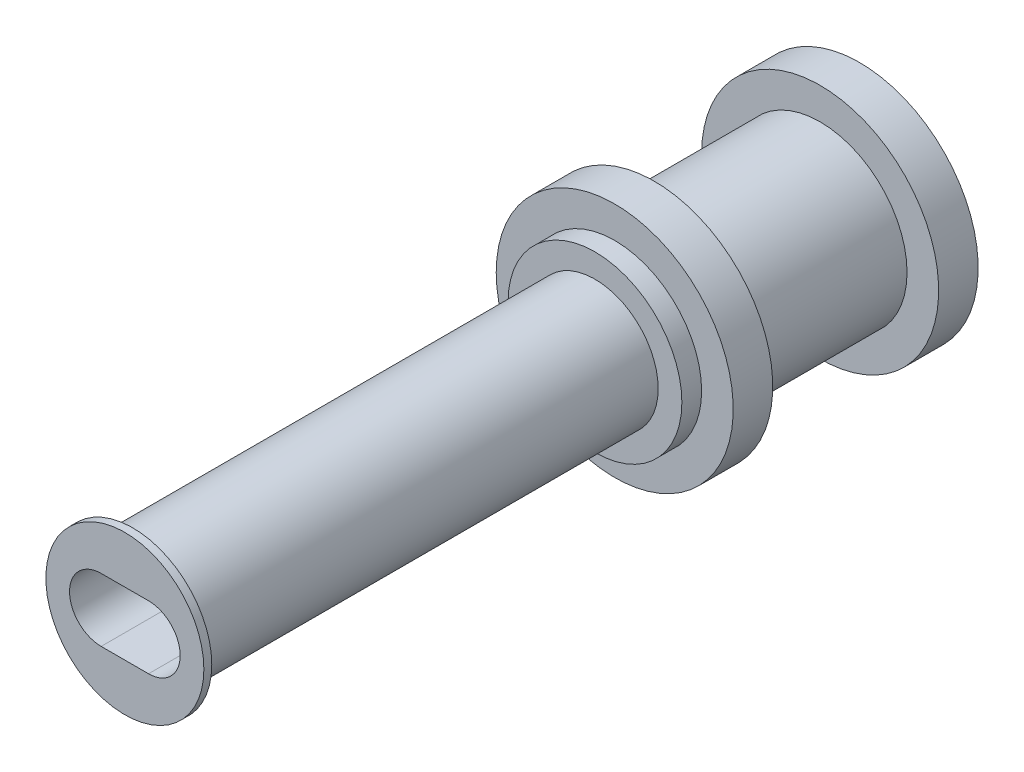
from build123d import *

# Parameters (mm, degrees)
SKETCH1_R           = 2.794
BOSS_EXTRUDE1_DEPTH = 3.937
SKETCH2_R           = 3.81
SKETCH2_R_2         = 2.794
BOSS_EXTRUDE2_DEPTH = 1.27
SKETCH3_R           = 2.794
BOSS_EXTRUDE3_DEPTH = 0.635
SKETCH4_R           = 2.032
BOSS_EXTRUDE4_DEPTH = 15.113
BOSS_EXTRUDE5_START = -0.254
SKETCH5_R           = 2.54
SKETCH5_R_2         = 2.032
BOSS_EXTRUDE5_DEPTH = 0.254
CUT_EXTRUDE1_DEPTH  = 15.24


with BuildPart() as part:
    # Sketch1 → Boss-Extrude1 (new body)
    with BuildSketch(Plane.XY):
        with Locations((7.874, 0)):
            Circle(SKETCH1_R)
        with BuildLine():
            Line((6.35, 0.762), (7.112, 0.762))
            Line((7.112, 0.762), (7.112, 1.524))
            ThreePointArc((7.112, 1.524), (7.874, 2.286), (8.636, 1.524))
            Line((8.636, 1.524), (8.636, 0.762))
            Line((8.636, 0.762), (9.398, 0.762))
            ThreePointArc((9.398, 0.762), (10.16, 0), (9.398, -0.762))
            Line((9.398, -0.762), (8.636, -0.762))
            Line((8.636, -0.762), (8.636, -1.524))
            ThreePointArc((8.636, -1.524), (7.874, -2.286), (7.112, -1.524))
            Line((7.112, -1.524), (7.112, -0.762))
            Line((7.112, -0.762), (6.35, -0.762))
            ThreePointArc((6.35, -0.762), (5.588, 0), (6.35, 0.762))
        make_face(mode=Mode.SUBTRACT)
    boss_extrude1 = extrude(amount=BOSS_EXTRUDE1_DEPTH)

    # Sketch2 → Boss-Extrude2 (add)
    with BuildSketch(Plane(origin=(0, 0, 0), x_dir=(-1, 0, 0), z_dir=(0, 0, -1))):
        with Locations((-7.874, 0)):
            Circle(SKETCH2_R)
        with Locations((-7.874, 0)):
            Circle(SKETCH2_R_2, mode=Mode.SUBTRACT)
    boss_extrude2 = extrude(amount=-BOSS_EXTRUDE2_DEPTH)

    # Mirror1: Boss-Extrude1, Boss-Extrude2 across plane
    add(boss_extrude1.mirror(Plane.XY.offset(3.937)))
    add(boss_extrude2.mirror(Plane.XY.offset(3.937)))

    # Sketch3 → Boss-Extrude3 (add)
    with BuildSketch(Plane.XY.offset(7.874)):
        with Locations(Location((7.874, 0, 0), (0, 0, 180))):
            Circle(SKETCH3_R)
    extrude(amount=BOSS_EXTRUDE3_DEPTH)

    # Sketch4 → Boss-Extrude4 (add)
    with BuildSketch(Plane.XY.offset(8.509)):
        with Locations((7.874, 0)):
            Circle(SKETCH4_R)
    extrude(amount=BOSS_EXTRUDE4_DEPTH)

    # Sketch5 → Boss-Extrude5 (add)
    with BuildSketch(Plane.XY.offset(23.622).offset(BOSS_EXTRUDE5_START)):
        with Locations((7.874, 0)):
            Circle(SKETCH5_R)
        with Locations((7.874, 0)):
            Circle(SKETCH5_R_2, mode=Mode.SUBTRACT)
    extrude(amount=BOSS_EXTRUDE5_DEPTH)

    # Sketch6 → Cut-Extrude1 (cut)
    with BuildSketch(Plane.XY.offset(23.622)):
        with BuildLine():
            Line((8.636, -1.016), (7.112, -1.016))
            ThreePointArc((7.112, -1.016), (6.096, 0), (7.112, 1.016))
            Line((7.112, 1.016), (8.636, 1.016))
            ThreePointArc((8.636, 1.016), (9.652, 0), (8.636, -1.016))
        make_face()
    extrude(amount=-CUT_EXTRUDE1_DEPTH, mode=Mode.SUBTRACT)


solid = part.part
